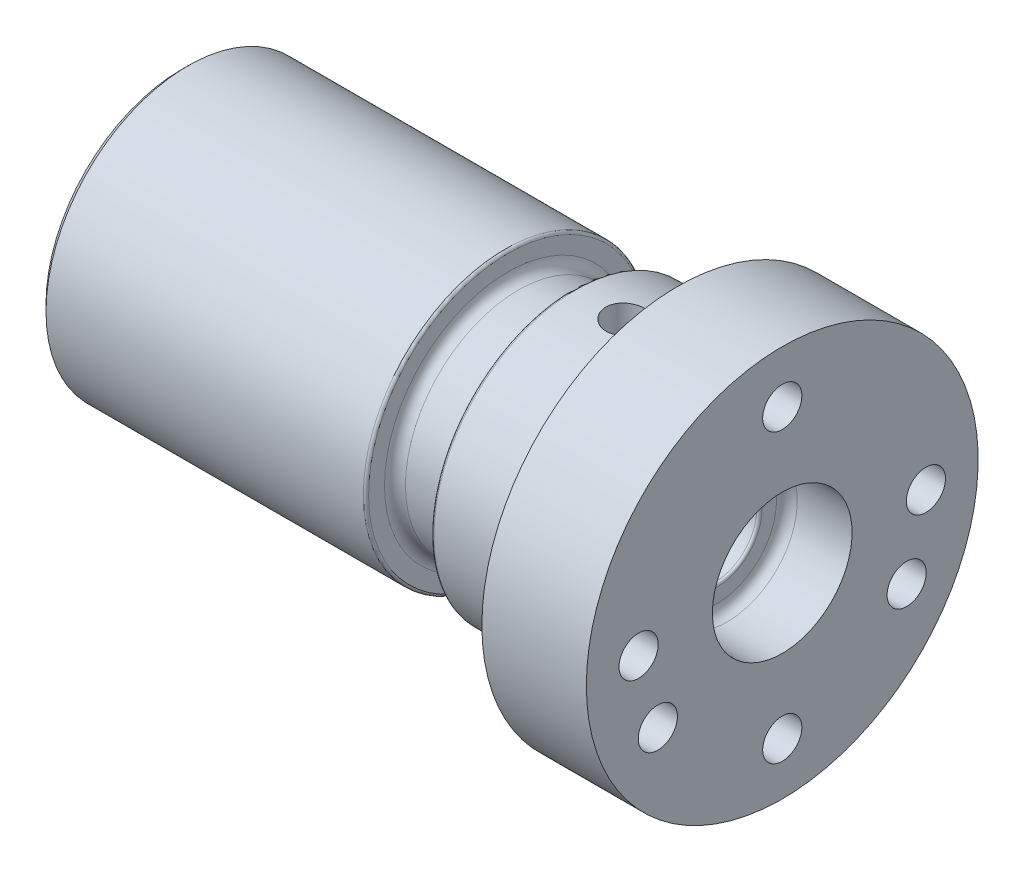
from build123d import *

# Parameters (mm, degrees)
CHAMFER1_SIZE      = 0.5
FILLET1_R          = 0.8
FILLET2_R          = 0.2
CIRPATTERN1_COUNT  = 2
CIRPATTERN2_COUNT  = 3
FILLET3_R          = 0.8
FILLET4_R          = 0.2
SKETCH9_W          = 3.05
SKETCH9_H          = 4.05
CUT_EXTRUDE1_DEPTH = 23
CIRPATTERN3_COUNT  = 4


with BuildPart() as part:
    # Sketch1 → Base-Revolve (revolve)
    with BuildSketch(Plane.XY, mode=Mode.PRIVATE) as base_revolve_sk:
        Polygon((41, 3.25), (31.5, 3.25), (31.5, 6), (0, 6), (0, 10.875), (25, 10.875), (25, 8.655), (30, 8.655), (30, 10.875), (38, 10.875), (38, 15), (46, 15), (46, 5.35), (41, 5.35), align=None)
    revolve(base_revolve_sk.sketch.rotate(Axis((0, 0, 0), (1, 0, 0)), 90), axis=Axis((0, 0, 0), (1, 0, 0)))

    # Chamfer1
    chamfer1_edges = [part.edges().sort_by_distance(p)[0] for p in [
        (0, 0, -10.875),
    ]]
    chamfer(chamfer1_edges, length=CHAMFER1_SIZE)

    # Sketch5 → M3.0 _3.000000_ Diameter Hole1 (revolve, cut)
    with BuildSketch(Plane(origin=(34, 11.125, 0), x_dir=(0, 0, 1), z_dir=(1, 0, 0))):
        Polygon((0, 0), (0, 5.901290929), (1.5, 5), (1.5, 0), align=None)
    m3_0_3_000000_diameter_hole1 = revolve(axis=Axis((34, 17.475, 0), (0, -1, 0)), mode=Mode.SUBTRACT)

    # Fillet1
    fillet1_edges = [part.edges().sort_by_distance(p)[0] for p in [
        (30, 0, -8.655),
        (25, 0, -8.655),
    ]]
    fillet(fillet1_edges, radius=FILLET1_R)

    # Fillet2
    fillet2_edges = [part.edges().sort_by_distance(p)[0] for p in [
        (30, 0, -10.875),
        (25, 0, -10.875),
    ]]
    fillet(fillet2_edges, radius=FILLET2_R)

    # Sketch7 → M3.0 _3.000000_ Diameter Hole2 (revolve, cut)
    with BuildSketch(Plane(origin=(46, 11, 0), x_dir=(0, 0, -1), z_dir=(0, 1, 0))):
        Polygon((0, 0), (0, 6.901290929), (1.5, 6), (1.5, 0), align=None)
    m3_0_3_000000_diameter_hole2 = revolve(axis=Axis((52.35, 11, 0), (-1, 0, 0)), mode=Mode.SUBTRACT)

    # CirPattern1: M3.0 _3.000000_ Diameter Hole1 ×2 about axis
    cirpattern1_axis = Axis((0, 0, 0), (1, 0, 0))
    for i in range(1, CIRPATTERN1_COUNT):
        add(m3_0_3_000000_diameter_hole1.rotate(cirpattern1_axis, i * 360 / CIRPATTERN1_COUNT), mode=Mode.SUBTRACT)

    # CirPattern2: M3.0 _3.000000_ Diameter Hole2 ×3 about axis
    cirpattern2_axis = Axis((0, 0, 0), (1, 0, 0))
    for i in range(1, CIRPATTERN2_COUNT):
        add(m3_0_3_000000_diameter_hole2.rotate(cirpattern2_axis, i * 360 / CIRPATTERN2_COUNT), mode=Mode.SUBTRACT)

    # Fillet3
    fillet3_edges = [part.edges().sort_by_distance(p)[0] for p in [
        (41, 0, -5.35),
    ]]
    fillet(fillet3_edges, radius=FILLET3_R)

    # Fillet4
    fillet4_edges = [part.edges().sort_by_distance(p)[0] for p in [
        (41, 0, -3.25),
    ]]
    fillet(fillet4_edges, radius=FILLET4_R)

    # Sketch9 → Cut-Extrude1 (cut)
    with BuildSketch(Plane.ZY):
        with Locations((0, 5.525)):
            Rectangle(SKETCH9_W, SKETCH9_H)
    extrude(amount=-CUT_EXTRUDE1_DEPTH, mode=Mode.SUBTRACT)

    # Sketch12 → M3.0 _3.000000_ Diameter Hole3 (revolve, cut)
    with BuildSketch(Plane(origin=(46, 11, 0), x_dir=(0, 0, -1), z_dir=(0, 1, 0))):
        Polygon((0, 0), (0, 6.901290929), (1.5, 6), (1.5, 0), align=None)
    m3_0_3_000000_diameter_hole3 = revolve(axis=Axis((52.35, 11, 0), (-1, 0, 0)), mode=Mode.SUBTRACT)

    # CirPattern3: M3.0 _3.000000_ Diameter Hole3 ×4 about axis
    cirpattern3_axis = Axis((0, 0, 0), (1, 0, 0))
    for i in range(1, CIRPATTERN3_COUNT):
        add(m3_0_3_000000_diameter_hole3.rotate(cirpattern3_axis, i * 360 / CIRPATTERN3_COUNT), mode=Mode.SUBTRACT)


solid = part.part
